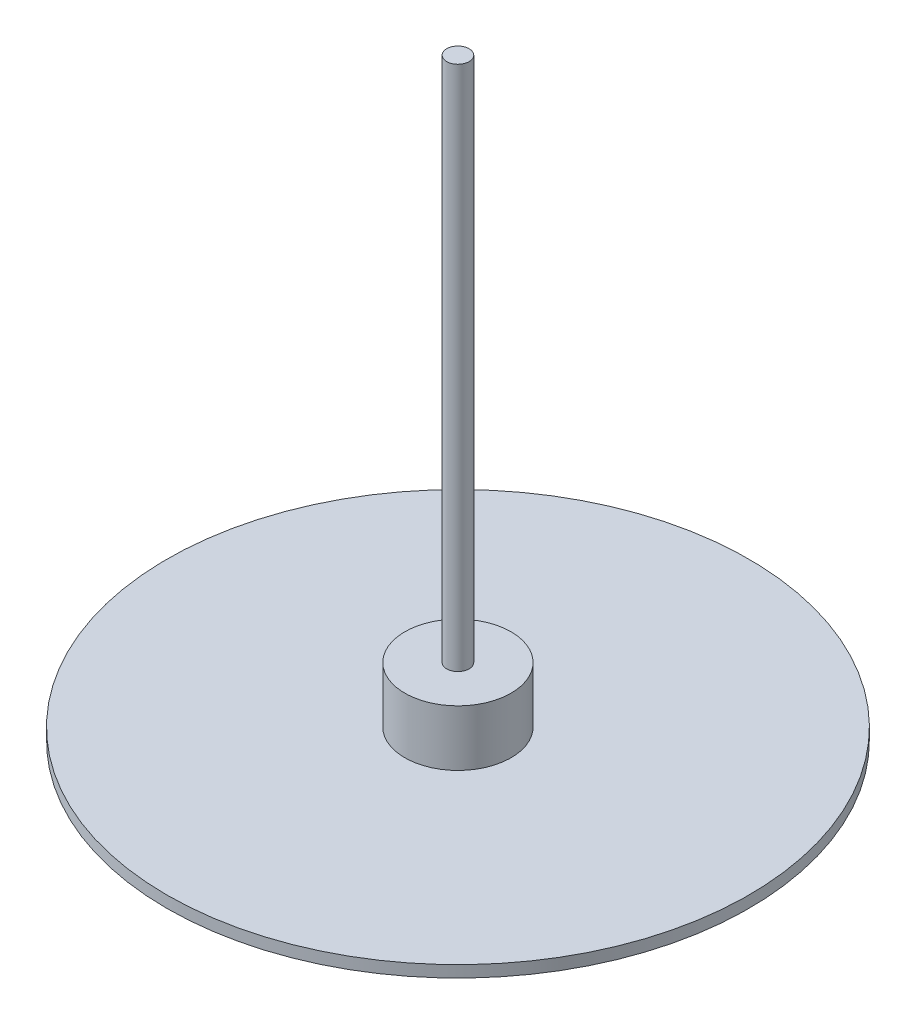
ISO-10303-21;
HEADER;
FILE_DESCRIPTION(('STEP AP214'),'2;1');
FILE_NAME('part.step','',(''),(''),'','','');
FILE_SCHEMA(('AUTOMOTIVE_DESIGN { 1 0 10303 214 1 1 1 1 }'));
ENDSEC;
DATA;
#1=APPLICATION_CONTEXT('core data for automotive mechanical design processes');
#2=APPLICATION_PROTOCOL_DEFINITION('international standard','automotive_design',2000,#1);
#3=PRODUCT_CONTEXT('',#1,'mechanical');
#4=PRODUCT('Part','Part','',(#3));
#5=PRODUCT_RELATED_PRODUCT_CATEGORY('part','',(#4));
#6=PRODUCT_DEFINITION_FORMATION('','',#4);
#7=PRODUCT_DEFINITION_CONTEXT('part definition',#1,'design');
#8=PRODUCT_DEFINITION('design','',#6,#7);
#9=PRODUCT_DEFINITION_SHAPE('','',#8);
#10=(LENGTH_UNIT() NAMED_UNIT(*) SI_UNIT(.MILLI.,.METRE.));
#11=(NAMED_UNIT(*) PLANE_ANGLE_UNIT() SI_UNIT($,.RADIAN.));
#12=(NAMED_UNIT(*) SI_UNIT($,.STERADIAN.) SOLID_ANGLE_UNIT());
#13=UNCERTAINTY_MEASURE_WITH_UNIT(LENGTH_MEASURE(1.E-05),#10,'distance_accuracy_value','');
#14=(GEOMETRIC_REPRESENTATION_CONTEXT(3) GLOBAL_UNCERTAINTY_ASSIGNED_CONTEXT((#13)) GLOBAL_UNIT_ASSIGNED_CONTEXT((#10,
#11,#12)) REPRESENTATION_CONTEXT('',''));
#15=CARTESIAN_POINT('',(0.,0.,0.));
#16=DIRECTION('',(0.,0.,1.));
#17=DIRECTION('',(1.,0.,0.));
#18=AXIS2_PLACEMENT_3D('',#15,#16,#17);
#19=CARTESIAN_POINT('',(0.,149.225,0.));
#20=DIRECTION('',(0.,-1.,0.));
#21=DIRECTION('',(0.,0.,-1.));
#22=AXIS2_PLACEMENT_3D('',#19,#20,#21);
#23=CYLINDRICAL_SURFACE('',#22,3.175);
#24=CARTESIAN_POINT('',(0.,149.225,0.));
#25=DIRECTION('',(0.,1.,0.));
#26=DIRECTION('',(0.,0.,1.));
#27=AXIS2_PLACEMENT_3D('',#24,#25,#26);
#28=CIRCLE('',#27,3.175);
#29=CARTESIAN_POINT('',(0.,149.225,3.175));
#30=VERTEX_POINT('',#29);
#31=EDGE_CURVE('E10',#30,#30,#28,.T.);
#32=ORIENTED_EDGE('',*,*,#31,.F.);
#33=EDGE_LOOP('',(#32));
#34=FACE_BOUND('',#33,.T.);
#35=CARTESIAN_POINT('',(0.,0.,0.));
#36=DIRECTION('',(0.,1.,0.));
#37=DIRECTION('',(0.,0.,1.));
#38=AXIS2_PLACEMENT_3D('',#35,#36,#37);
#39=CIRCLE('',#38,3.175);
#40=CARTESIAN_POINT('',(0.,0.,3.175));
#41=VERTEX_POINT('',#40);
#42=EDGE_CURVE('E42',#41,#41,#39,.T.);
#43=ORIENTED_EDGE('',*,*,#42,.T.);
#44=EDGE_LOOP('',(#43));
#45=FACE_BOUND('',#44,.T.);
#46=ADVANCED_FACE('F39',(#34,#45),#23,.T.);
#47=CARTESIAN_POINT('',(0.,149.225,0.));
#48=DIRECTION('',(0.,1.,0.));
#49=DIRECTION('',(0.,0.,1.));
#50=AXIS2_PLACEMENT_3D('',#47,#48,#49);
#51=PLANE('',#50);
#52=ORIENTED_EDGE('',*,*,#31,.T.);
#53=EDGE_LOOP('',(#52));
#54=FACE_BOUND('',#53,.T.);
#55=ADVANCED_FACE('F87',(#54),#51,.T.);
#56=CARTESIAN_POINT('',(0.,-15.875,0.));
#57=DIRECTION('',(0.,1.,0.));
#58=DIRECTION('',(0.,0.,1.));
#59=AXIS2_PLACEMENT_3D('',#56,#57,#58);
#60=CYLINDRICAL_SURFACE('',#59,15.08125);
#61=CARTESIAN_POINT('',(0.,-15.875,0.));
#62=DIRECTION('',(0.,-1.,0.));
#63=DIRECTION('',(0.,0.,-1.));
#64=AXIS2_PLACEMENT_3D('',#61,#62,#63);
#65=CIRCLE('',#64,15.08125);
#66=CARTESIAN_POINT('',(0.,-15.875,-15.08125));
#67=VERTEX_POINT('',#66);
#68=EDGE_CURVE('E51',#67,#67,#65,.T.);
#69=ORIENTED_EDGE('',*,*,#68,.F.);
#70=EDGE_LOOP('',(#69));
#71=FACE_BOUND('',#70,.T.);
#72=CARTESIAN_POINT('',(0.,0.,0.));
#73=DIRECTION('',(0.,-1.,0.));
#74=DIRECTION('',(0.,0.,-1.));
#75=AXIS2_PLACEMENT_3D('',#72,#73,#74);
#76=CIRCLE('',#75,15.08125);
#77=CARTESIAN_POINT('',(0.,0.,-15.08125));
#78=VERTEX_POINT('',#77);
#79=EDGE_CURVE('E53',#78,#78,#76,.T.);
#80=ORIENTED_EDGE('',*,*,#79,.T.);
#81=EDGE_LOOP('',(#80));
#82=FACE_BOUND('',#81,.T.);
#83=ADVANCED_FACE('F92',(#71,#82),#60,.T.);
#84=CARTESIAN_POINT('',(0.,0.,0.));
#85=DIRECTION('',(0.,-1.,0.));
#86=DIRECTION('',(0.,0.,-1.));
#87=AXIS2_PLACEMENT_3D('',#84,#85,#86);
#88=PLANE('',#87);
#89=ORIENTED_EDGE('',*,*,#42,.F.);
#90=EDGE_LOOP('',(#89));
#91=FACE_BOUND('',#90,.T.);
#92=ORIENTED_EDGE('',*,*,#79,.F.);
#93=EDGE_LOOP('',(#92));
#94=FACE_BOUND('',#93,.T.);
#95=ADVANCED_FACE('F74',(#91,#94),#88,.F.);
#96=CARTESIAN_POINT('',(0.,-19.177,0.));
#97=DIRECTION('',(0.,1.,0.));
#98=DIRECTION('',(0.,0.,1.));
#99=AXIS2_PLACEMENT_3D('',#96,#97,#98);
#100=CYLINDRICAL_SURFACE('',#99,82.55);
#101=CARTESIAN_POINT('',(0.,-19.177,0.));
#102=DIRECTION('',(0.,-1.,0.));
#103=DIRECTION('',(0.,0.,-1.));
#104=AXIS2_PLACEMENT_3D('',#101,#102,#103);
#105=CIRCLE('',#104,82.55);
#106=CARTESIAN_POINT('',(0.,-19.177,82.55));
#107=VERTEX_POINT('',#106);
#108=EDGE_CURVE('E57',#107,#107,#105,.T.);
#109=CARTESIAN_POINT('',(0.,-15.875,0.));
#110=DIRECTION('',(0.,-1.,0.));
#111=DIRECTION('',(0.,0.,-1.));
#112=AXIS2_PLACEMENT_3D('',#109,#110,#111);
#113=CIRCLE('',#112,82.55);
#114=CARTESIAN_POINT('',(0.,-15.875,82.55));
#115=VERTEX_POINT('',#114);
#116=EDGE_CURVE('E61',#115,#115,#113,.T.);
#117=CARTESIAN_POINT('',(0.,-19.177,82.55));
#118=CARTESIAN_POINT('',(0.,-19.1426041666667,82.55));
#119=CARTESIAN_POINT('',(0.,-19.1082083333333,82.55));
#120=CARTESIAN_POINT('',(0.,-19.0394166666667,82.55));
#121=CARTESIAN_POINT('',(0.,-19.0050208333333,82.55));
#122=CARTESIAN_POINT('',(0.,-18.9362291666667,82.55));
#123=CARTESIAN_POINT('',(0.,-18.9018333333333,82.55));
#124=CARTESIAN_POINT('',(0.,-18.8330416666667,82.55));
#125=CARTESIAN_POINT('',(0.,-18.7986458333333,82.55));
#126=CARTESIAN_POINT('',(0.,-18.7298541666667,82.55));
#127=CARTESIAN_POINT('',(0.,-18.6954583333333,82.55));
#128=CARTESIAN_POINT('',(0.,-18.6266666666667,82.55));
#129=CARTESIAN_POINT('',(0.,-18.5922708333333,82.55));
#130=CARTESIAN_POINT('',(0.,-18.5234791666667,82.55));
#131=CARTESIAN_POINT('',(0.,-18.4890833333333,82.55));
#132=CARTESIAN_POINT('',(0.,-18.4202916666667,82.55));
#133=CARTESIAN_POINT('',(0.,-18.3858958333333,82.55));
#134=CARTESIAN_POINT('',(0.,-18.3171041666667,82.55));
#135=CARTESIAN_POINT('',(0.,-18.2827083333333,82.55));
#136=CARTESIAN_POINT('',(0.,-18.2139166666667,82.55));
#137=CARTESIAN_POINT('',(0.,-18.1795208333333,82.55));
#138=CARTESIAN_POINT('',(0.,-18.1107291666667,82.55));
#139=CARTESIAN_POINT('',(0.,-18.0763333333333,82.55));
#140=CARTESIAN_POINT('',(0.,-18.0075416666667,82.55));
#141=CARTESIAN_POINT('',(0.,-17.9731458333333,82.55));
#142=CARTESIAN_POINT('',(0.,-17.9043541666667,82.55));
#143=CARTESIAN_POINT('',(0.,-17.8699583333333,82.55));
#144=CARTESIAN_POINT('',(0.,-17.8011666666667,82.55));
#145=CARTESIAN_POINT('',(0.,-17.7667708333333,82.55));
#146=CARTESIAN_POINT('',(0.,-17.6979791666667,82.55));
#147=CARTESIAN_POINT('',(0.,-17.6635833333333,82.55));
#148=CARTESIAN_POINT('',(0.,-17.5947916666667,82.55));
#149=CARTESIAN_POINT('',(0.,-17.5603958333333,82.55));
#150=CARTESIAN_POINT('',(0.,-17.4916041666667,82.55));
#151=CARTESIAN_POINT('',(0.,-17.4572083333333,82.55));
#152=CARTESIAN_POINT('',(0.,-17.3884166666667,82.55));
#153=CARTESIAN_POINT('',(0.,-17.3540208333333,82.55));
#154=CARTESIAN_POINT('',(0.,-17.2852291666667,82.55));
#155=CARTESIAN_POINT('',(0.,-17.2508333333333,82.55));
#156=CARTESIAN_POINT('',(0.,-17.1820416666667,82.55));
#157=CARTESIAN_POINT('',(0.,-17.1476458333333,82.55));
#158=CARTESIAN_POINT('',(0.,-17.0788541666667,82.55));
#159=CARTESIAN_POINT('',(0.,-17.0444583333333,82.55));
#160=CARTESIAN_POINT('',(0.,-16.9756666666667,82.55));
#161=CARTESIAN_POINT('',(0.,-16.9412708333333,82.55));
#162=CARTESIAN_POINT('',(0.,-16.8724791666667,82.55));
#163=CARTESIAN_POINT('',(0.,-16.8380833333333,82.55));
#164=CARTESIAN_POINT('',(0.,-16.7692916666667,82.55));
#165=CARTESIAN_POINT('',(0.,-16.7348958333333,82.55));
#166=CARTESIAN_POINT('',(0.,-16.6661041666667,82.55));
#167=CARTESIAN_POINT('',(0.,-16.6317083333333,82.55));
#168=CARTESIAN_POINT('',(0.,-16.5629166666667,82.55));
#169=CARTESIAN_POINT('',(0.,-16.5285208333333,82.55));
#170=CARTESIAN_POINT('',(0.,-16.4597291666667,82.55));
#171=CARTESIAN_POINT('',(0.,-16.4253333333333,82.55));
#172=CARTESIAN_POINT('',(0.,-16.3565416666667,82.55));
#173=CARTESIAN_POINT('',(0.,-16.3221458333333,82.55));
#174=CARTESIAN_POINT('',(0.,-16.2533541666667,82.55));
#175=CARTESIAN_POINT('',(0.,-16.2189583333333,82.55));
#176=CARTESIAN_POINT('',(0.,-16.1501666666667,82.55));
#177=CARTESIAN_POINT('',(0.,-16.1157708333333,82.55));
#178=CARTESIAN_POINT('',(0.,-16.0469791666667,82.55));
#179=CARTESIAN_POINT('',(0.,-16.0125833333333,82.55));
#180=CARTESIAN_POINT('',(0.,-15.9437916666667,82.55));
#181=CARTESIAN_POINT('',(0.,-15.9093958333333,82.55));
#182=CARTESIAN_POINT('',(0.,-15.875,82.55));
#183=B_SPLINE_CURVE_WITH_KNOTS('',3,(#117,#118,#119,#120,#121,#122,#123,#124,#125,#126,#127,
#128,#129,#130,#131,#132,#133,#134,#135,#136,#137,#138,#139,#140,#141,#142,#143,#144,#145,#146,
#147,#148,#149,#150,#151,#152,#153,#154,#155,#156,#157,#158,#159,#160,#161,#162,#163,#164,#165,
#166,#167,#168,#169,#170,#171,#172,#173,#174,#175,#176,#177,#178,#179,#180,#181,#182),
.UNSPECIFIED.,.F.,.F.,(4,2,2,2,2,2,2,2,2,2,2,2,2,2,2,2,2,2,2,2,2,2,2,2,2,2,2,2,2,2,2,2,4),(0.,
0.103187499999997,0.206374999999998,0.309562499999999,0.41275,0.515937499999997,
0.619124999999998,0.722312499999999,0.8255,0.928687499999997,1.031875,1.1350625,1.23825,
1.3414375,1.444625,1.5478125,1.651,1.7541875,1.857375,1.9605625,2.06375,2.1669375,2.270125,
2.3733125,2.4765,2.5796875,2.682875,2.7860625,2.88925,2.9924375,3.095625,3.1988125,3.302),.UNSPECIFIED.);
#184=EDGE_CURVE('BSEAM71',#107,#115,#183,.T.);
#185=ORIENTED_EDGE('',*,*,#108,.F.);
#186=ORIENTED_EDGE('',*,*,#116,.T.);
#187=ORIENTED_EDGE('',*,*,#184,.T.);
#188=ORIENTED_EDGE('',*,*,#184,.F.);
#189=EDGE_LOOP('',(#185,#187,#186,#188));
#190=FACE_BOUND('',#189,.T.);
#191=ADVANCED_FACE('F71',(#190),#100,.T.);
#192=CARTESIAN_POINT('',(0.,-19.177,0.));
#193=DIRECTION('',(0.,-1.,0.));
#194=DIRECTION('',(0.,0.,-1.));
#195=AXIS2_PLACEMENT_3D('',#192,#193,#194);
#196=PLANE('',#195);
#197=ORIENTED_EDGE('',*,*,#108,.T.);
#198=EDGE_LOOP('',(#197));
#199=FACE_BOUND('',#198,.T.);
#200=ADVANCED_FACE('F69',(#199),#196,.T.);
#201=CARTESIAN_POINT('',(0.,-15.875,0.));
#202=DIRECTION('',(0.,-1.,0.));
#203=DIRECTION('',(0.,0.,-1.));
#204=AXIS2_PLACEMENT_3D('',#201,#202,#203);
#205=PLANE('',#204);
#206=ORIENTED_EDGE('',*,*,#68,.T.);
#207=EDGE_LOOP('',(#206));
#208=FACE_BOUND('',#207,.T.);
#209=ORIENTED_EDGE('',*,*,#116,.F.);
#210=EDGE_LOOP('',(#209));
#211=FACE_BOUND('',#210,.T.);
#212=ADVANCED_FACE('F78',(#208,#211),#205,.F.);
#213=CLOSED_SHELL('',(#46,#55,#83,#95,#191,#200,#212));
#214=MANIFOLD_SOLID_BREP('B2',#213);
#215=ADVANCED_BREP_SHAPE_REPRESENTATION('',(#18,#214),#14);
#216=SHAPE_DEFINITION_REPRESENTATION(#9,#215);
ENDSEC;
END-ISO-10303-21;
